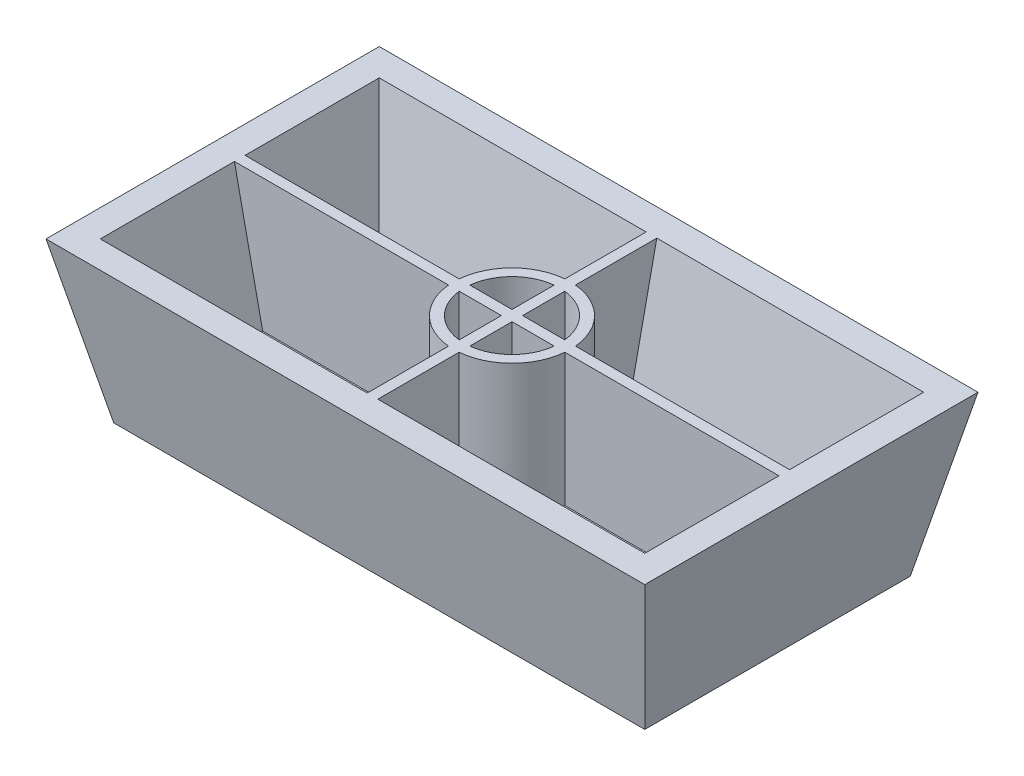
ISO-10303-21;
HEADER;
FILE_DESCRIPTION(('STEP AP214'),'2;1');
FILE_NAME('part.step','',(''),(''),'','','');
FILE_SCHEMA(('AUTOMOTIVE_DESIGN { 1 0 10303 214 1 1 1 1 }'));
ENDSEC;
DATA;
#1=APPLICATION_CONTEXT('core data for automotive mechanical design processes');
#2=APPLICATION_PROTOCOL_DEFINITION('international standard','automotive_design',2000,#1);
#3=PRODUCT_CONTEXT('',#1,'mechanical');
#4=PRODUCT('Part','Part','',(#3));
#5=PRODUCT_RELATED_PRODUCT_CATEGORY('part','',(#4));
#6=PRODUCT_DEFINITION_FORMATION('','',#4);
#7=PRODUCT_DEFINITION_CONTEXT('part definition',#1,'design');
#8=PRODUCT_DEFINITION('design','',#6,#7);
#9=PRODUCT_DEFINITION_SHAPE('','',#8);
#10=(LENGTH_UNIT() NAMED_UNIT(*) SI_UNIT(.MILLI.,.METRE.));
#11=(NAMED_UNIT(*) PLANE_ANGLE_UNIT() SI_UNIT($,.RADIAN.));
#12=(NAMED_UNIT(*) SI_UNIT($,.STERADIAN.) SOLID_ANGLE_UNIT());
#13=UNCERTAINTY_MEASURE_WITH_UNIT(LENGTH_MEASURE(1.E-05),#10,'distance_accuracy_value','');
#14=(GEOMETRIC_REPRESENTATION_CONTEXT(3) GLOBAL_UNCERTAINTY_ASSIGNED_CONTEXT((#13)) GLOBAL_UNIT_ASSIGNED_CONTEXT((#10,
#11,#12)) REPRESENTATION_CONTEXT('',''));
#15=CARTESIAN_POINT('',(0.,0.,0.));
#16=DIRECTION('',(0.,0.,1.));
#17=DIRECTION('',(1.,0.,0.));
#18=AXIS2_PLACEMENT_3D('',#15,#16,#17);
#19=CARTESIAN_POINT('',(0.,5.,-50.));
#20=DIRECTION('',(0.,-1.,0.));
#21=DIRECTION('',(0.,0.,-1.));
#22=AXIS2_PLACEMENT_3D('',#19,#20,#21);
#23=PLANE('',#22);
#24=DIRECTION('',(0.,0.,1.));
#25=VECTOR('',#24,1.);
#26=CARTESIAN_POINT('',(49.,5.,-50.));
#27=LINE('',#26,#25);
#28=CARTESIAN_POINT('',(49.,5.,-14.0455488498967));
#29=VERTEX_POINT('',#28);
#30=CARTESIAN_POINT('',(49.,5.,-4.04892016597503));
#31=VERTEX_POINT('',#30);
#32=EDGE_CURVE('E272',#29,#31,#27,.T.);
#33=ORIENTED_EDGE('',*,*,#32,.F.);
#34=CARTESIAN_POINT('',(50.,5.,-25.));
#35=DIRECTION('',(0.,-1.,0.));
#36=DIRECTION('',(0.,0.,-1.));
#37=AXIS2_PLACEMENT_3D('',#34,#35,#36);
#38=CIRCLE('',#37,11.);
#39=CARTESIAN_POINT('',(39.0455488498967,5.,-24.));
#40=VERTEX_POINT('',#39);
#41=EDGE_CURVE('E341',#40,#29,#38,.F.);
#42=ORIENTED_EDGE('',*,*,#41,.F.);
#43=DIRECTION('',(1.,0.,0.));
#44=VECTOR('',#43,1.);
#45=CARTESIAN_POINT('',(0.,5.,-24.));
#46=LINE('',#45,#44);
#47=CARTESIAN_POINT('',(4.04892016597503,5.,-24.));
#48=VERTEX_POINT('',#47);
#49=EDGE_CURVE('E566',#48,#40,#46,.T.);
#50=ORIENTED_EDGE('',*,*,#49,.F.);
#51=DIRECTION('',(0.,0.,-1.));
#52=VECTOR('',#51,1.);
#53=CARTESIAN_POINT('',(4.04892016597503,5.,-50.));
#54=LINE('',#53,#52);
#55=CARTESIAN_POINT('',(4.04892016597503,5.,-4.04892016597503));
#56=VERTEX_POINT('',#55);
#57=EDGE_CURVE('E418',#48,#56,#54,.F.);
#58=ORIENTED_EDGE('',*,*,#57,.T.);
#59=DIRECTION('',(-1.,0.,0.));
#60=VECTOR('',#59,1.);
#61=CARTESIAN_POINT('',(0.,5.,-4.04892016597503));
#62=LINE('',#61,#60);
#63=EDGE_CURVE('E424',#56,#31,#62,.F.);
#64=ORIENTED_EDGE('',*,*,#63,.T.);
#65=EDGE_LOOP('',(#33,#42,#50,#58,#64));
#66=FACE_BOUND('',#65,.T.);
#67=ADVANCED_FACE('F33',(#66),#23,.F.);
#68=CARTESIAN_POINT('',(50.,30.,-25.));
#69=DIRECTION('',(0.,-1.,0.));
#70=DIRECTION('',(0.,0.,-1.));
#71=AXIS2_PLACEMENT_3D('',#68,#69,#70);
#72=CYLINDRICAL_SURFACE('',#71,9.);
#73=CARTESIAN_POINT('',(50.,30.,-25.));
#74=DIRECTION('',(0.,-1.,0.));
#75=DIRECTION('',(0.,0.,-1.));
#76=AXIS2_PLACEMENT_3D('',#73,#74,#75);
#77=CIRCLE('',#76,9.);
#78=CARTESIAN_POINT('',(41.0557280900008,30.,-24.));
#79=VERTEX_POINT('',#78);
#80=CARTESIAN_POINT('',(49.,30.,-16.0557280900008));
#81=VERTEX_POINT('',#80);
#82=EDGE_CURVE('E409',#79,#81,#77,.F.);
#83=ORIENTED_EDGE('',*,*,#82,.T.);
#84=DIRECTION('',(0.,-1.,0.));
#85=VECTOR('',#84,1.);
#86=CARTESIAN_POINT('',(49.,30.,-16.0557280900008));
#87=LINE('',#86,#85);
#88=CARTESIAN_POINT('',(49.,5.,-16.0557280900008));
#89=VERTEX_POINT('',#88);
#90=EDGE_CURVE('E522',#81,#89,#87,.T.);
#91=ORIENTED_EDGE('',*,*,#90,.T.);
#92=CARTESIAN_POINT('',(50.,5.,-25.));
#93=DIRECTION('',(0.,-1.,0.));
#94=DIRECTION('',(0.,0.,-1.));
#95=AXIS2_PLACEMENT_3D('',#92,#93,#94);
#96=CIRCLE('',#95,9.);
#97=CARTESIAN_POINT('',(41.0557280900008,5.,-24.));
#98=VERTEX_POINT('',#97);
#99=EDGE_CURVE('E415',#98,#89,#96,.F.);
#100=ORIENTED_EDGE('',*,*,#99,.F.);
#101=DIRECTION('',(0.,-1.,0.));
#102=VECTOR('',#101,1.);
#103=CARTESIAN_POINT('',(41.0557280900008,30.,-24.));
#104=LINE('',#103,#102);
#105=EDGE_CURVE('E449',#98,#79,#104,.F.);
#106=ORIENTED_EDGE('',*,*,#105,.T.);
#107=EDGE_LOOP('',(#83,#91,#100,#106));
#108=FACE_BOUND('',#107,.T.);
#109=ADVANCED_FACE('F545',(#108),#72,.F.);
#110=CARTESIAN_POINT('',(50.,30.,-25.));
#111=DIRECTION('',(0.,-1.,0.));
#112=DIRECTION('',(0.,0.,-1.));
#113=AXIS2_PLACEMENT_3D('',#110,#111,#112);
#114=CYLINDRICAL_SURFACE('',#113,11.);
#115=DIRECTION('',(0.,-1.,0.));
#116=VECTOR('',#115,1.);
#117=CARTESIAN_POINT('',(49.,30.,-14.0455488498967));
#118=LINE('',#117,#116);
#119=CARTESIAN_POINT('',(49.,30.,-14.0455488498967));
#120=VERTEX_POINT('',#119);
#121=EDGE_CURVE('E508',#120,#29,#118,.T.);
#122=ORIENTED_EDGE('',*,*,#121,.F.);
#123=CARTESIAN_POINT('',(50.,30.,-25.));
#124=DIRECTION('',(0.,-1.,0.));
#125=DIRECTION('',(0.,0.,-1.));
#126=AXIS2_PLACEMENT_3D('',#123,#124,#125);
#127=CIRCLE('',#126,11.);
#128=CARTESIAN_POINT('',(39.0455488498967,30.,-24.));
#129=VERTEX_POINT('',#128);
#130=EDGE_CURVE('E286',#129,#120,#127,.F.);
#131=ORIENTED_EDGE('',*,*,#130,.F.);
#132=DIRECTION('',(0.,-1.,0.));
#133=VECTOR('',#132,1.);
#134=CARTESIAN_POINT('',(39.0455488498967,30.,-24.));
#135=LINE('',#134,#133);
#136=EDGE_CURVE('E869',#40,#129,#135,.F.);
#137=ORIENTED_EDGE('',*,*,#136,.F.);
#138=ORIENTED_EDGE('',*,*,#41,.T.);
#139=EDGE_LOOP('',(#122,#131,#137,#138));
#140=FACE_BOUND('',#139,.T.);
#141=ADVANCED_FACE('F594',(#140),#114,.T.);
#142=DIRECTION('',(0.,0.,1.));
#143=VECTOR('',#142,1.);
#144=CARTESIAN_POINT('',(49.,5.,-50.));
#145=LINE('',#144,#143);
#146=CARTESIAN_POINT('',(49.,5.,-24.));
#147=VERTEX_POINT('',#146);
#148=EDGE_CURVE('E525',#147,#89,#145,.T.);
#149=ORIENTED_EDGE('',*,*,#148,.F.);
#150=DIRECTION('',(1.,0.,0.));
#151=VECTOR('',#150,1.);
#152=CARTESIAN_POINT('',(0.,5.,-24.));
#153=LINE('',#152,#151);
#154=EDGE_CURVE('E346',#98,#147,#153,.T.);
#155=ORIENTED_EDGE('',*,*,#154,.F.);
#156=ORIENTED_EDGE('',*,*,#99,.T.);
#157=EDGE_LOOP('',(#149,#155,#156));
#158=FACE_BOUND('',#157,.T.);
#159=ADVANCED_FACE('F590',(#158),#23,.F.);
#160=DIRECTION('',(0.,0.,1.));
#161=VECTOR('',#160,1.);
#162=CARTESIAN_POINT('',(49.,5.,-50.));
#163=LINE('',#162,#161);
#164=CARTESIAN_POINT('',(49.,5.,-45.951079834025));
#165=VERTEX_POINT('',#164);
#166=CARTESIAN_POINT('',(49.,5.,-35.9544511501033));
#167=VERTEX_POINT('',#166);
#168=EDGE_CURVE('E440',#165,#167,#163,.T.);
#169=ORIENTED_EDGE('',*,*,#168,.F.);
#170=DIRECTION('',(1.,0.,0.));
#171=VECTOR('',#170,1.);
#172=CARTESIAN_POINT('',(0.,5.,-45.951079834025));
#173=LINE('',#172,#171);
#174=CARTESIAN_POINT('',(4.04892016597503,5.,-45.951079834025));
#175=VERTEX_POINT('',#174);
#176=EDGE_CURVE('E432',#165,#175,#173,.F.);
#177=ORIENTED_EDGE('',*,*,#176,.T.);
#178=CARTESIAN_POINT('',(4.04892016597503,5.,-26.));
#179=VERTEX_POINT('',#178);
#180=EDGE_CURVE('E377',#175,#179,#54,.F.);
#181=ORIENTED_EDGE('',*,*,#180,.T.);
#182=DIRECTION('',(1.,0.,0.));
#183=VECTOR('',#182,1.);
#184=CARTESIAN_POINT('',(0.,5.,-26.));
#185=LINE('',#184,#183);
#186=CARTESIAN_POINT('',(39.0455488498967,5.,-26.));
#187=VERTEX_POINT('',#186);
#188=EDGE_CURVE('E374',#179,#187,#185,.T.);
#189=ORIENTED_EDGE('',*,*,#188,.T.);
#190=EDGE_CURVE('E320',#167,#187,#38,.F.);
#191=ORIENTED_EDGE('',*,*,#190,.F.);
#192=EDGE_LOOP('',(#169,#177,#181,#189,#191));
#193=FACE_BOUND('',#192,.T.);
#194=ADVANCED_FACE('F375',(#193),#23,.F.);
#195=CARTESIAN_POINT('',(0.,1.0395584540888,-4.89073800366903));
#196=DIRECTION('',(0.,-0.20791169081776,0.978147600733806));
#197=DIRECTION('',(0.,-0.978147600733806,-0.20791169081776));
#198=AXIS2_PLACEMENT_3D('',#195,#196,#197);
#199=PLANE('',#198);
#200=DIRECTION('',(-1.,0.,0.));
#201=VECTOR('',#200,1.);
#202=CARTESIAN_POINT('',(0.,30.,1.26499387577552));
#203=LINE('',#202,#201);
#204=CARTESIAN_POINT('',(-1.26499387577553,30.,1.26499387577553));
#205=VERTEX_POINT('',#204);
#206=CARTESIAN_POINT('',(49.,30.,1.26499387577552));
#207=VERTEX_POINT('',#206);
#208=EDGE_CURVE('E284',#205,#207,#203,.F.);
#209=ORIENTED_EDGE('',*,*,#208,.T.);
#210=DIRECTION('',(0.,0.978147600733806,0.20791169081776));
#211=VECTOR('',#210,1.);
#212=CARTESIAN_POINT('',(49.,1.0395584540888,-4.89073800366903));
#213=LINE('',#212,#211);
#214=EDGE_CURVE('E266',#207,#31,#213,.F.);
#215=ORIENTED_EDGE('',*,*,#214,.T.);
#216=ORIENTED_EDGE('',*,*,#63,.F.);
#217=DIRECTION('',(0.203558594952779,-0.957667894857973,-0.203558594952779));
#218=VECTOR('',#217,1.);
#219=CARTESIAN_POINT('',(4.68808488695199,1.99296640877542,-4.68808488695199));
#220=LINE('',#219,#218);
#221=EDGE_CURVE('E293',#205,#56,#220,.T.);
#222=ORIENTED_EDGE('',*,*,#221,.F.);
#223=EDGE_LOOP('',(#209,#215,#216,#222));
#224=FACE_BOUND('',#223,.T.);
#225=ADVANCED_FACE('F291',(#224),#199,.F.);
#226=CARTESIAN_POINT('',(0.,1.0395584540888,-45.109261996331));
#227=DIRECTION('',(0.,-0.20791169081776,-0.978147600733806));
#228=DIRECTION('',(0.,0.978147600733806,-0.20791169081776));
#229=AXIS2_PLACEMENT_3D('',#226,#227,#228);
#230=PLANE('',#229);
#231=ORIENTED_EDGE('',*,*,#176,.F.);
#232=DIRECTION('',(0.,-0.978147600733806,0.20791169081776));
#233=VECTOR('',#232,1.);
#234=CARTESIAN_POINT('',(49.,1.0395584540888,-45.109261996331));
#235=LINE('',#234,#233);
#236=CARTESIAN_POINT('',(49.,30.,-51.2649938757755));
#237=VERTEX_POINT('',#236);
#238=EDGE_CURVE('E56',#165,#237,#235,.F.);
#239=ORIENTED_EDGE('',*,*,#238,.T.);
#240=DIRECTION('',(1.,0.,0.));
#241=VECTOR('',#240,1.);
#242=CARTESIAN_POINT('',(0.,30.,-51.2649938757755));
#243=LINE('',#242,#241);
#244=CARTESIAN_POINT('',(-1.26499387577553,30.,-51.2649938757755));
#245=VERTEX_POINT('',#244);
#246=EDGE_CURVE('E304',#237,#245,#243,.F.);
#247=ORIENTED_EDGE('',*,*,#246,.T.);
#248=DIRECTION('',(0.203558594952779,-0.957667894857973,0.203558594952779));
#249=VECTOR('',#248,1.);
#250=CARTESIAN_POINT('',(6.75988996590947,-7.75411014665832,-43.2401100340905));
#251=LINE('',#250,#249);
#252=EDGE_CURVE('E307',#245,#175,#251,.T.);
#253=ORIENTED_EDGE('',*,*,#252,.T.);
#254=EDGE_LOOP('',(#231,#239,#247,#253));
#255=FACE_BOUND('',#254,.T.);
#256=ADVANCED_FACE('F442',(#255),#230,.F.);
#257=CARTESIAN_POINT('',(49.,5.,-33.9442719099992));
#258=VERTEX_POINT('',#257);
#259=CARTESIAN_POINT('',(41.0557280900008,5.,-26.));
#260=VERTEX_POINT('',#259);
#261=EDGE_CURVE('E414',#258,#260,#96,.F.);
#262=ORIENTED_EDGE('',*,*,#261,.F.);
#263=DIRECTION('',(0.,-1.,0.));
#264=VECTOR('',#263,1.);
#265=CARTESIAN_POINT('',(49.,30.,-33.9442719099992));
#266=LINE('',#265,#264);
#267=CARTESIAN_POINT('',(49.,30.,-33.9442719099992));
#268=VERTEX_POINT('',#267);
#269=EDGE_CURVE('E514',#258,#268,#266,.F.);
#270=ORIENTED_EDGE('',*,*,#269,.T.);
#271=CARTESIAN_POINT('',(41.0557280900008,30.,-26.));
#272=VERTEX_POINT('',#271);
#273=EDGE_CURVE('E408',#268,#272,#77,.F.);
#274=ORIENTED_EDGE('',*,*,#273,.T.);
#275=DIRECTION('',(0.,-1.,0.));
#276=VECTOR('',#275,1.);
#277=CARTESIAN_POINT('',(41.0557280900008,30.,-26.));
#278=LINE('',#277,#276);
#279=EDGE_CURVE('E389',#260,#272,#278,.F.);
#280=ORIENTED_EDGE('',*,*,#279,.F.);
#281=EDGE_LOOP('',(#262,#270,#274,#280));
#282=FACE_BOUND('',#281,.T.);
#283=ADVANCED_FACE('F596',(#282),#72,.F.);
#284=DIRECTION('',(0.,-1.,0.));
#285=VECTOR('',#284,1.);
#286=CARTESIAN_POINT('',(49.,30.,-35.9544511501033));
#287=LINE('',#286,#285);
#288=CARTESIAN_POINT('',(49.,30.,-35.9544511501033));
#289=VERTEX_POINT('',#288);
#290=EDGE_CURVE('E369',#167,#289,#287,.F.);
#291=ORIENTED_EDGE('',*,*,#290,.F.);
#292=ORIENTED_EDGE('',*,*,#190,.T.);
#293=DIRECTION('',(0.,-1.,0.));
#294=VECTOR('',#293,1.);
#295=CARTESIAN_POINT('',(39.0455488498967,30.,-26.));
#296=LINE('',#295,#294);
#297=CARTESIAN_POINT('',(39.0455488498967,30.,-26.));
#298=VERTEX_POINT('',#297);
#299=EDGE_CURVE('E366',#187,#298,#296,.F.);
#300=ORIENTED_EDGE('',*,*,#299,.T.);
#301=EDGE_CURVE('E399',#289,#298,#127,.F.);
#302=ORIENTED_EDGE('',*,*,#301,.F.);
#303=EDGE_LOOP('',(#291,#292,#300,#302));
#304=FACE_BOUND('',#303,.T.);
#305=ADVANCED_FACE('F364',(#304),#114,.T.);
#306=DIRECTION('',(0.,0.,1.));
#307=VECTOR('',#306,1.);
#308=CARTESIAN_POINT('',(49.,5.,-50.));
#309=LINE('',#308,#307);
#310=CARTESIAN_POINT('',(49.,5.,-26.));
#311=VERTEX_POINT('',#310);
#312=EDGE_CURVE('E517',#258,#311,#309,.T.);
#313=ORIENTED_EDGE('',*,*,#312,.F.);
#314=ORIENTED_EDGE('',*,*,#261,.T.);
#315=DIRECTION('',(1.,0.,0.));
#316=VECTOR('',#315,1.);
#317=CARTESIAN_POINT('',(0.,5.,-26.));
#318=LINE('',#317,#316);
#319=EDGE_CURVE('E342',#260,#311,#318,.T.);
#320=ORIENTED_EDGE('',*,*,#319,.T.);
#321=EDGE_LOOP('',(#313,#314,#320));
#322=FACE_BOUND('',#321,.T.);
#323=ADVANCED_FACE('F735',(#322),#23,.F.);
#324=CARTESIAN_POINT('',(-1.26499387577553,30.,-26.));
#325=DIRECTION('',(0.,0.,-1.));
#326=DIRECTION('',(-1.,0.,0.));
#327=AXIS2_PLACEMENT_3D('',#324,#325,#326);
#328=PLANE('',#327);
#329=DIRECTION('',(-1.,0.,0.));
#330=VECTOR('',#329,1.);
#331=CARTESIAN_POINT('',(-1.26499387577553,30.,-26.));
#332=LINE('',#331,#330);
#333=CARTESIAN_POINT('',(49.,30.,-26.));
#334=VERTEX_POINT('',#333);
#335=EDGE_CURVE('E450',#272,#334,#332,.F.);
#336=ORIENTED_EDGE('',*,*,#335,.T.);
#337=DIRECTION('',(0.,-1.,0.));
#338=VECTOR('',#337,1.);
#339=CARTESIAN_POINT('',(49.,30.,-26.));
#340=LINE('',#339,#338);
#341=EDGE_CURVE('E519',#334,#311,#340,.T.);
#342=ORIENTED_EDGE('',*,*,#341,.T.);
#343=ORIENTED_EDGE('',*,*,#319,.F.);
#344=ORIENTED_EDGE('',*,*,#279,.T.);
#345=EDGE_LOOP('',(#336,#342,#343,#344));
#346=FACE_BOUND('',#345,.T.);
#347=ADVANCED_FACE('F571',(#346),#328,.T.);
#348=CARTESIAN_POINT('',(-1.26499387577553,30.,-24.));
#349=DIRECTION('',(0.,0.,-1.));
#350=DIRECTION('',(-1.,0.,0.));
#351=AXIS2_PLACEMENT_3D('',#348,#349,#350);
#352=PLANE('',#351);
#353=DIRECTION('',(0.,-1.,0.));
#354=VECTOR('',#353,1.);
#355=CARTESIAN_POINT('',(49.,30.,-24.));
#356=LINE('',#355,#354);
#357=CARTESIAN_POINT('',(49.,30.,-24.));
#358=VERTEX_POINT('',#357);
#359=EDGE_CURVE('E37',#358,#147,#356,.T.);
#360=ORIENTED_EDGE('',*,*,#359,.F.);
#361=DIRECTION('',(-1.,0.,0.));
#362=VECTOR('',#361,1.);
#363=CARTESIAN_POINT('',(-1.26499387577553,30.,-24.));
#364=LINE('',#363,#362);
#365=EDGE_CURVE('E466',#79,#358,#364,.F.);
#366=ORIENTED_EDGE('',*,*,#365,.F.);
#367=ORIENTED_EDGE('',*,*,#105,.F.);
#368=ORIENTED_EDGE('',*,*,#154,.T.);
#369=EDGE_LOOP('',(#360,#366,#367,#368));
#370=FACE_BOUND('',#369,.T.);
#371=ADVANCED_FACE('F733',(#370),#352,.F.);
#372=CARTESIAN_POINT('',(51.,5.,-14.0455488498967));
#373=VERTEX_POINT('',#372);
#374=CARTESIAN_POINT('',(60.9544511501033,5.,-24.));
#375=VERTEX_POINT('',#374);
#376=EDGE_CURVE('E340',#373,#375,#38,.F.);
#377=ORIENTED_EDGE('',*,*,#376,.F.);
#378=DIRECTION('',(0.,0.,1.));
#379=VECTOR('',#378,1.);
#380=CARTESIAN_POINT('',(51.,5.,-50.));
#381=LINE('',#380,#379);
#382=CARTESIAN_POINT('',(51.,5.,-4.04892016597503));
#383=VERTEX_POINT('',#382);
#384=EDGE_CURVE('E482',#373,#383,#381,.T.);
#385=ORIENTED_EDGE('',*,*,#384,.T.);
#386=CARTESIAN_POINT('',(95.951079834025,5.,-4.04892016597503));
#387=VERTEX_POINT('',#386);
#388=EDGE_CURVE('E417',#383,#387,#62,.F.);
#389=ORIENTED_EDGE('',*,*,#388,.T.);
#390=DIRECTION('',(0.,0.,1.));
#391=VECTOR('',#390,1.);
#392=CARTESIAN_POINT('',(95.951079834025,5.,-50.));
#393=LINE('',#392,#391);
#394=CARTESIAN_POINT('',(95.951079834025,5.,-24.));
#395=VERTEX_POINT('',#394);
#396=EDGE_CURVE('E429',#387,#395,#393,.F.);
#397=ORIENTED_EDGE('',*,*,#396,.T.);
#398=EDGE_CURVE('E562',#375,#395,#46,.T.);
#399=ORIENTED_EDGE('',*,*,#398,.F.);
#400=EDGE_LOOP('',(#377,#385,#389,#397,#399));
#401=FACE_BOUND('',#400,.T.);
#402=ADVANCED_FACE('F690',(#401),#23,.F.);
#403=CARTESIAN_POINT('',(4.89073800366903,1.0395584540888,0.));
#404=DIRECTION('',(-0.978147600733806,-0.20791169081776,0.));
#405=DIRECTION('',(0.20791169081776,-0.978147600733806,0.));
#406=AXIS2_PLACEMENT_3D('',#403,#404,#405);
#407=PLANE('',#406);
#408=ORIENTED_EDGE('',*,*,#57,.F.);
#409=DIRECTION('',(0.20791169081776,-0.978147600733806,0.));
#410=VECTOR('',#409,1.);
#411=CARTESIAN_POINT('',(4.89073800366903,1.0395584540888,-24.));
#412=LINE('',#411,#410);
#413=CARTESIAN_POINT('',(-1.26499387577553,30.,-24.));
#414=VERTEX_POINT('',#413);
#415=EDGE_CURVE('E563',#48,#414,#412,.F.);
#416=ORIENTED_EDGE('',*,*,#415,.T.);
#417=DIRECTION('',(0.,0.,-1.));
#418=VECTOR('',#417,1.);
#419=CARTESIAN_POINT('',(-1.26499387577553,30.,-50.));
#420=LINE('',#419,#418);
#421=EDGE_CURVE('E436',#414,#205,#420,.F.);
#422=ORIENTED_EDGE('',*,*,#421,.T.);
#423=ORIENTED_EDGE('',*,*,#221,.T.);
#424=EDGE_LOOP('',(#408,#416,#422,#423));
#425=FACE_BOUND('',#424,.T.);
#426=ADVANCED_FACE('F653',(#425),#407,.F.);
#427=CARTESIAN_POINT('',(95.109261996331,1.0395584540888,0.));
#428=DIRECTION('',(0.978147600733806,-0.20791169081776,0.));
#429=DIRECTION('',(0.20791169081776,0.978147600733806,0.));
#430=AXIS2_PLACEMENT_3D('',#427,#428,#429);
#431=PLANE('',#430);
#432=DIRECTION('',(0.,0.,1.));
#433=VECTOR('',#432,1.);
#434=CARTESIAN_POINT('',(101.264993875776,30.,-50.));
#435=LINE('',#434,#433);
#436=CARTESIAN_POINT('',(101.264993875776,30.,1.26499387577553));
#437=VERTEX_POINT('',#436);
#438=CARTESIAN_POINT('',(101.264993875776,30.,-24.));
#439=VERTEX_POINT('',#438);
#440=EDGE_CURVE('E297',#437,#439,#435,.F.);
#441=ORIENTED_EDGE('',*,*,#440,.T.);
#442=DIRECTION('',(0.20791169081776,0.978147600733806,0.));
#443=VECTOR('',#442,1.);
#444=CARTESIAN_POINT('',(95.109261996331,1.0395584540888,-24.));
#445=LINE('',#444,#443);
#446=EDGE_CURVE('E560',#439,#395,#445,.F.);
#447=ORIENTED_EDGE('',*,*,#446,.T.);
#448=ORIENTED_EDGE('',*,*,#396,.F.);
#449=DIRECTION('',(-0.203558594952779,-0.957667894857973,-0.203558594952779));
#450=VECTOR('',#449,1.);
#451=CARTESIAN_POINT('',(95.311915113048,1.99296640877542,-4.68808488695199));
#452=LINE('',#451,#450);
#453=EDGE_CURVE('E420',#437,#387,#452,.T.);
#454=ORIENTED_EDGE('',*,*,#453,.F.);
#455=EDGE_LOOP('',(#441,#447,#448,#454));
#456=FACE_BOUND('',#455,.T.);
#457=ADVANCED_FACE('F707',(#456),#431,.F.);
#458=DIRECTION('',(0.,-1.,0.));
#459=VECTOR('',#458,1.);
#460=CARTESIAN_POINT('',(51.,30.,-16.0557280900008));
#461=LINE('',#460,#459);
#462=CARTESIAN_POINT('',(51.,30.,-16.0557280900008));
#463=VERTEX_POINT('',#462);
#464=CARTESIAN_POINT('',(51.,5.,-16.0557280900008));
#465=VERTEX_POINT('',#464);
#466=EDGE_CURVE('E503',#463,#465,#461,.T.);
#467=ORIENTED_EDGE('',*,*,#466,.F.);
#468=CARTESIAN_POINT('',(58.9442719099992,30.,-24.));
#469=VERTEX_POINT('',#468);
#470=EDGE_CURVE('E407',#463,#469,#77,.F.);
#471=ORIENTED_EDGE('',*,*,#470,.T.);
#472=DIRECTION('',(0.,-1.,0.));
#473=VECTOR('',#472,1.);
#474=CARTESIAN_POINT('',(58.9442719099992,30.,-24.));
#475=LINE('',#474,#473);
#476=CARTESIAN_POINT('',(58.9442719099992,5.,-24.));
#477=VERTEX_POINT('',#476);
#478=EDGE_CURVE('E453',#469,#477,#475,.T.);
#479=ORIENTED_EDGE('',*,*,#478,.T.);
#480=EDGE_CURVE('E413',#465,#477,#96,.F.);
#481=ORIENTED_EDGE('',*,*,#480,.F.);
#482=EDGE_LOOP('',(#467,#471,#479,#481));
#483=FACE_BOUND('',#482,.T.);
#484=ADVANCED_FACE('F625',(#483),#72,.F.);
#485=CARTESIAN_POINT('',(51.,30.,-14.0455488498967));
#486=VERTEX_POINT('',#485);
#487=CARTESIAN_POINT('',(60.9544511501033,30.,-24.));
#488=VERTEX_POINT('',#487);
#489=EDGE_CURVE('E403',#486,#488,#127,.F.);
#490=ORIENTED_EDGE('',*,*,#489,.F.);
#491=DIRECTION('',(0.,-1.,0.));
#492=VECTOR('',#491,1.);
#493=CARTESIAN_POINT('',(51.,30.,-14.0455488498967));
#494=LINE('',#493,#492);
#495=EDGE_CURVE('E478',#486,#373,#494,.T.);
#496=ORIENTED_EDGE('',*,*,#495,.T.);
#497=ORIENTED_EDGE('',*,*,#376,.T.);
#498=DIRECTION('',(0.,-1.,0.));
#499=VECTOR('',#498,1.);
#500=CARTESIAN_POINT('',(60.9544511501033,30.,-24.));
#501=LINE('',#500,#499);
#502=EDGE_CURVE('E557',#488,#375,#501,.T.);
#503=ORIENTED_EDGE('',*,*,#502,.F.);
#504=EDGE_LOOP('',(#490,#496,#497,#503));
#505=FACE_BOUND('',#504,.T.);
#506=ADVANCED_FACE('F561',(#505),#114,.T.);
#507=CARTESIAN_POINT('',(51.,5.,-24.));
#508=VERTEX_POINT('',#507);
#509=EDGE_CURVE('E348',#508,#477,#153,.T.);
#510=ORIENTED_EDGE('',*,*,#509,.F.);
#511=DIRECTION('',(0.,0.,1.));
#512=VECTOR('',#511,1.);
#513=CARTESIAN_POINT('',(51.,5.,-50.));
#514=LINE('',#513,#512);
#515=EDGE_CURVE('E505',#508,#465,#514,.T.);
#516=ORIENTED_EDGE('',*,*,#515,.T.);
#517=ORIENTED_EDGE('',*,*,#480,.T.);
#518=EDGE_LOOP('',(#510,#516,#517));
#519=FACE_BOUND('',#518,.T.);
#520=ADVANCED_FACE('F584',(#519),#23,.F.);
#521=CARTESIAN_POINT('',(95.951079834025,5.,-45.951079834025));
#522=VERTEX_POINT('',#521);
#523=CARTESIAN_POINT('',(51.,5.,-45.951079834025));
#524=VERTEX_POINT('',#523);
#525=EDGE_CURVE('E434',#522,#524,#173,.F.);
#526=ORIENTED_EDGE('',*,*,#525,.T.);
#527=DIRECTION('',(0.,0.,1.));
#528=VECTOR('',#527,1.);
#529=CARTESIAN_POINT('',(51.,5.,-50.));
#530=LINE('',#529,#528);
#531=CARTESIAN_POINT('',(51.,5.,-35.9544511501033));
#532=VERTEX_POINT('',#531);
#533=EDGE_CURVE('E492',#524,#532,#530,.T.);
#534=ORIENTED_EDGE('',*,*,#533,.T.);
#535=CARTESIAN_POINT('',(60.9544511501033,5.,-26.));
#536=VERTEX_POINT('',#535);
#537=EDGE_CURVE('E337',#536,#532,#38,.F.);
#538=ORIENTED_EDGE('',*,*,#537,.F.);
#539=CARTESIAN_POINT('',(95.951079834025,5.,-26.));
#540=VERTEX_POINT('',#539);
#541=EDGE_CURVE('E382',#536,#540,#185,.T.);
#542=ORIENTED_EDGE('',*,*,#541,.T.);
#543=EDGE_CURVE('E426',#540,#522,#393,.F.);
#544=ORIENTED_EDGE('',*,*,#543,.T.);
#545=EDGE_LOOP('',(#526,#534,#538,#542,#544));
#546=FACE_BOUND('',#545,.T.);
#547=ADVANCED_FACE('F575',(#546),#23,.F.);
#548=CARTESIAN_POINT('',(0.,30.,-50.));
#549=DIRECTION('',(0.,-1.,0.));
#550=DIRECTION('',(0.,0.,-1.));
#551=AXIS2_PLACEMENT_3D('',#548,#549,#550);
#552=PLANE('',#551);
#553=CARTESIAN_POINT('',(51.,30.,-26.));
#554=VERTEX_POINT('',#553);
#555=CARTESIAN_POINT('',(58.9442719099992,30.,-26.));
#556=VERTEX_POINT('',#555);
#557=EDGE_CURVE('E452',#554,#556,#332,.F.);
#558=ORIENTED_EDGE('',*,*,#557,.F.);
#559=DIRECTION('',(0.,0.,-1.));
#560=VECTOR('',#559,1.);
#561=CARTESIAN_POINT('',(51.,30.,-51.2649938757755));
#562=LINE('',#561,#560);
#563=CARTESIAN_POINT('',(51.,30.,-33.9442719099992));
#564=VERTEX_POINT('',#563);
#565=EDGE_CURVE('E529',#564,#554,#562,.F.);
#566=ORIENTED_EDGE('',*,*,#565,.F.);
#567=EDGE_CURVE('E404',#556,#564,#77,.F.);
#568=ORIENTED_EDGE('',*,*,#567,.F.);
#569=EDGE_LOOP('',(#558,#566,#568));
#570=FACE_BOUND('',#569,.T.);
#571=DIRECTION('',(0.,0.,-1.));
#572=VECTOR('',#571,1.);
#573=CARTESIAN_POINT('',(49.,30.,-51.2649938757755));
#574=LINE('',#573,#572);
#575=EDGE_CURVE('E289',#237,#289,#574,.F.);
#576=ORIENTED_EDGE('',*,*,#575,.T.);
#577=ORIENTED_EDGE('',*,*,#301,.T.);
#578=CARTESIAN_POINT('',(-1.26499387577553,30.,-26.));
#579=VERTEX_POINT('',#578);
#580=EDGE_CURVE('E385',#579,#298,#332,.F.);
#581=ORIENTED_EDGE('',*,*,#580,.F.);
#582=EDGE_CURVE('E299',#245,#579,#420,.F.);
#583=ORIENTED_EDGE('',*,*,#582,.F.);
#584=ORIENTED_EDGE('',*,*,#246,.F.);
#585=EDGE_LOOP('',(#576,#577,#581,#583,#584));
#586=FACE_BOUND('',#585,.T.);
#587=CARTESIAN_POINT('',(51.,30.,1.26499387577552));
#588=VERTEX_POINT('',#587);
#589=EDGE_CURVE('E295',#588,#437,#203,.F.);
#590=ORIENTED_EDGE('',*,*,#589,.F.);
#591=EDGE_CURVE('E530',#486,#588,#562,.F.);
#592=ORIENTED_EDGE('',*,*,#591,.F.);
#593=ORIENTED_EDGE('',*,*,#489,.T.);
#594=EDGE_CURVE('E470',#488,#439,#364,.F.);
#595=ORIENTED_EDGE('',*,*,#594,.T.);
#596=ORIENTED_EDGE('',*,*,#440,.F.);
#597=EDGE_LOOP('',(#590,#592,#593,#595,#596));
#598=FACE_BOUND('',#597,.T.);
#599=ORIENTED_EDGE('',*,*,#470,.F.);
#600=CARTESIAN_POINT('',(51.,30.,-24.));
#601=VERTEX_POINT('',#600);
#602=EDGE_CURVE('E533',#601,#463,#562,.F.);
#603=ORIENTED_EDGE('',*,*,#602,.F.);
#604=EDGE_CURVE('E467',#601,#469,#364,.F.);
#605=ORIENTED_EDGE('',*,*,#604,.T.);
#606=EDGE_LOOP('',(#599,#603,#605));
#607=FACE_BOUND('',#606,.T.);
#608=DIRECTION('',(1.,0.,0.));
#609=VECTOR('',#608,1.);
#610=CARTESIAN_POINT('',(0.,30.,-56.3766968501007));
#611=LINE('',#610,#609);
#612=CARTESIAN_POINT('',(106.376696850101,30.,-56.3766968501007));
#613=VERTEX_POINT('',#612);
#614=CARTESIAN_POINT('',(-6.37669685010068,30.,-56.3766968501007));
#615=VERTEX_POINT('',#614);
#616=EDGE_CURVE('E326',#613,#615,#611,.F.);
#617=ORIENTED_EDGE('',*,*,#616,.T.);
#618=DIRECTION('',(0.,0.,-1.));
#619=VECTOR('',#618,1.);
#620=CARTESIAN_POINT('',(-6.37669685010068,30.,-50.));
#621=LINE('',#620,#619);
#622=CARTESIAN_POINT('',(-6.37669685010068,30.,6.37669685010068));
#623=VERTEX_POINT('',#622);
#624=EDGE_CURVE('E316',#615,#623,#621,.F.);
#625=ORIENTED_EDGE('',*,*,#624,.T.);
#626=DIRECTION('',(-1.,0.,0.));
#627=VECTOR('',#626,1.);
#628=CARTESIAN_POINT('',(0.,30.,6.37669685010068));
#629=LINE('',#628,#627);
#630=CARTESIAN_POINT('',(106.376696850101,30.,6.37669685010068));
#631=VERTEX_POINT('',#630);
#632=EDGE_CURVE('E332',#623,#631,#629,.F.);
#633=ORIENTED_EDGE('',*,*,#632,.T.);
#634=DIRECTION('',(0.,0.,1.));
#635=VECTOR('',#634,1.);
#636=CARTESIAN_POINT('',(106.376696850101,30.,-50.));
#637=LINE('',#636,#635);
#638=EDGE_CURVE('E334',#631,#613,#637,.F.);
#639=ORIENTED_EDGE('',*,*,#638,.T.);
#640=EDGE_LOOP('',(#617,#625,#633,#639));
#641=FACE_BOUND('',#640,.T.);
#642=ORIENTED_EDGE('',*,*,#273,.F.);
#643=EDGE_CURVE('E531',#268,#334,#574,.F.);
#644=ORIENTED_EDGE('',*,*,#643,.T.);
#645=ORIENTED_EDGE('',*,*,#335,.F.);
#646=EDGE_LOOP('',(#642,#644,#645));
#647=FACE_BOUND('',#646,.T.);
#648=EDGE_CURVE('E287',#358,#81,#574,.F.);
#649=ORIENTED_EDGE('',*,*,#648,.T.);
#650=ORIENTED_EDGE('',*,*,#82,.F.);
#651=ORIENTED_EDGE('',*,*,#365,.T.);
#652=EDGE_LOOP('',(#649,#650,#651));
#653=FACE_BOUND('',#652,.T.);
#654=ORIENTED_EDGE('',*,*,#130,.T.);
#655=EDGE_CURVE('E269',#120,#207,#574,.F.);
#656=ORIENTED_EDGE('',*,*,#655,.T.);
#657=ORIENTED_EDGE('',*,*,#208,.F.);
#658=ORIENTED_EDGE('',*,*,#421,.F.);
#659=EDGE_CURVE('E462',#414,#129,#364,.F.);
#660=ORIENTED_EDGE('',*,*,#659,.T.);
#661=EDGE_LOOP('',(#654,#656,#657,#658,#660));
#662=FACE_BOUND('',#661,.T.);
#663=CARTESIAN_POINT('',(60.9544511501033,30.,-26.));
#664=VERTEX_POINT('',#663);
#665=CARTESIAN_POINT('',(51.,30.,-35.9544511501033));
#666=VERTEX_POINT('',#665);
#667=EDGE_CURVE('E400',#664,#666,#127,.F.);
#668=ORIENTED_EDGE('',*,*,#667,.T.);
#669=CARTESIAN_POINT('',(51.,30.,-51.2649938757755));
#670=VERTEX_POINT('',#669);
#671=EDGE_CURVE('E527',#670,#666,#562,.F.);
#672=ORIENTED_EDGE('',*,*,#671,.F.);
#673=CARTESIAN_POINT('',(101.264993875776,30.,-51.2649938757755));
#674=VERTEX_POINT('',#673);
#675=EDGE_CURVE('E305',#674,#670,#243,.F.);
#676=ORIENTED_EDGE('',*,*,#675,.F.);
#677=CARTESIAN_POINT('',(101.264993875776,30.,-26.));
#678=VERTEX_POINT('',#677);
#679=EDGE_CURVE('E294',#678,#674,#435,.F.);
#680=ORIENTED_EDGE('',*,*,#679,.F.);
#681=EDGE_CURVE('E456',#664,#678,#332,.F.);
#682=ORIENTED_EDGE('',*,*,#681,.F.);
#683=EDGE_LOOP('',(#668,#672,#676,#680,#682));
#684=FACE_BOUND('',#683,.T.);
#685=ADVANCED_FACE('F281',(#570,#586,#598,#607,#641,#647,#653,#662,#684),#552,.F.);
#686=CARTESIAN_POINT('',(0.,0.,0.));
#687=DIRECTION('',(-0.978147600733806,-0.20791169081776,0.));
#688=DIRECTION('',(0.20791169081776,-0.978147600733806,0.));
#689=AXIS2_PLACEMENT_3D('',#686,#687,#688);
#690=PLANE('',#689);
#691=DIRECTION('',(0.203558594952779,-0.957667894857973,-0.203558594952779));
#692=VECTOR('',#691,1.);
#693=CARTESIAN_POINT('',(0.,0.,0.));
#694=LINE('',#693,#692);
#695=CARTESIAN_POINT('',(0.,0.,0.));
#696=VERTEX_POINT('',#695);
#697=EDGE_CURVE('E317',#623,#696,#694,.T.);
#698=ORIENTED_EDGE('',*,*,#697,.F.);
#699=ORIENTED_EDGE('',*,*,#624,.F.);
#700=DIRECTION('',(0.203558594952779,-0.957667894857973,0.203558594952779));
#701=VECTOR('',#700,1.);
#702=CARTESIAN_POINT('',(2.07180507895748,-9.74707655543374,-47.9281949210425));
#703=LINE('',#702,#701);
#704=CARTESIAN_POINT('',(0.,0.,-50.));
#705=VERTEX_POINT('',#704);
#706=EDGE_CURVE('E322',#615,#705,#703,.T.);
#707=ORIENTED_EDGE('',*,*,#706,.T.);
#708=DIRECTION('',(0.,0.,1.));
#709=VECTOR('',#708,1.);
#710=CARTESIAN_POINT('',(0.,0.,0.));
#711=LINE('',#710,#709);
#712=EDGE_CURVE('E308',#705,#696,#711,.T.);
#713=ORIENTED_EDGE('',*,*,#712,.T.);
#714=EDGE_LOOP('',(#698,#699,#707,#713));
#715=FACE_BOUND('',#714,.T.);
#716=ADVANCED_FACE('F574',(#715),#690,.T.);
#717=CARTESIAN_POINT('',(0.,0.,0.));
#718=DIRECTION('',(0.,-0.20791169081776,0.978147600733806));
#719=DIRECTION('',(0.,-0.978147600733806,-0.20791169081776));
#720=AXIS2_PLACEMENT_3D('',#717,#718,#719);
#721=PLANE('',#720);
#722=DIRECTION('',(1.,0.,0.));
#723=VECTOR('',#722,1.);
#724=CARTESIAN_POINT('',(0.,0.,0.));
#725=LINE('',#724,#723);
#726=CARTESIAN_POINT('',(100.,0.,0.));
#727=VERTEX_POINT('',#726);
#728=EDGE_CURVE('E310',#696,#727,#725,.T.);
#729=ORIENTED_EDGE('',*,*,#728,.T.);
#730=DIRECTION('',(-0.203558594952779,-0.957667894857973,-0.203558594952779));
#731=VECTOR('',#730,1.);
#732=CARTESIAN_POINT('',(100.,0.,0.));
#733=LINE('',#732,#731);
#734=EDGE_CURVE('E321',#631,#727,#733,.T.);
#735=ORIENTED_EDGE('',*,*,#734,.F.);
#736=ORIENTED_EDGE('',*,*,#632,.F.);
#737=ORIENTED_EDGE('',*,*,#697,.T.);
#738=EDGE_LOOP('',(#729,#735,#736,#737));
#739=FACE_BOUND('',#738,.T.);
#740=ADVANCED_FACE('F35',(#739),#721,.T.);
#741=CARTESIAN_POINT('',(100.,0.,0.));
#742=DIRECTION('',(0.978147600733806,-0.20791169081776,0.));
#743=DIRECTION('',(0.20791169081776,0.978147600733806,0.));
#744=AXIS2_PLACEMENT_3D('',#741,#742,#743);
#745=PLANE('',#744);
#746=DIRECTION('',(0.,0.,-1.));
#747=VECTOR('',#746,1.);
#748=CARTESIAN_POINT('',(100.,0.,0.));
#749=LINE('',#748,#747);
#750=CARTESIAN_POINT('',(100.,0.,-50.));
#751=VERTEX_POINT('',#750);
#752=EDGE_CURVE('E312',#727,#751,#749,.T.);
#753=ORIENTED_EDGE('',*,*,#752,.T.);
#754=DIRECTION('',(-0.203558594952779,-0.957667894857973,0.203558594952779));
#755=VECTOR('',#754,1.);
#756=CARTESIAN_POINT('',(95.856389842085,-19.4941531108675,-45.856389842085));
#757=LINE('',#756,#755);
#758=EDGE_CURVE('E325',#613,#751,#757,.T.);
#759=ORIENTED_EDGE('',*,*,#758,.F.);
#760=ORIENTED_EDGE('',*,*,#638,.F.);
#761=ORIENTED_EDGE('',*,*,#734,.T.);
#762=EDGE_LOOP('',(#753,#759,#760,#761));
#763=FACE_BOUND('',#762,.T.);
#764=ADVANCED_FACE('F643',(#763),#745,.T.);
#765=CARTESIAN_POINT('',(0.,0.,-50.));
#766=DIRECTION('',(0.,-0.20791169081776,-0.978147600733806));
#767=DIRECTION('',(0.,0.978147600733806,-0.20791169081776));
#768=AXIS2_PLACEMENT_3D('',#765,#766,#767);
#769=PLANE('',#768);
#770=ORIENTED_EDGE('',*,*,#706,.F.);
#771=ORIENTED_EDGE('',*,*,#616,.F.);
#772=ORIENTED_EDGE('',*,*,#758,.T.);
#773=DIRECTION('',(-1.,0.,0.));
#774=VECTOR('',#773,1.);
#775=CARTESIAN_POINT('',(0.,0.,-50.));
#776=LINE('',#775,#774);
#777=EDGE_CURVE('E314',#751,#705,#776,.T.);
#778=ORIENTED_EDGE('',*,*,#777,.T.);
#779=EDGE_LOOP('',(#770,#771,#772,#778));
#780=FACE_BOUND('',#779,.T.);
#781=ADVANCED_FACE('F634',(#780),#769,.T.);
#782=CARTESIAN_POINT('',(0.,0.,-50.));
#783=DIRECTION('',(0.,-1.,0.));
#784=DIRECTION('',(0.,0.,-1.));
#785=AXIS2_PLACEMENT_3D('',#782,#783,#784);
#786=PLANE('',#785);
#787=ORIENTED_EDGE('',*,*,#752,.F.);
#788=ORIENTED_EDGE('',*,*,#728,.F.);
#789=ORIENTED_EDGE('',*,*,#712,.F.);
#790=ORIENTED_EDGE('',*,*,#777,.F.);
#791=EDGE_LOOP('',(#787,#788,#789,#790));
#792=FACE_BOUND('',#791,.T.);
#793=ADVANCED_FACE('F645',(#792),#786,.T.);
#794=DIRECTION('',(0.20791169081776,-0.978147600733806,0.));
#795=VECTOR('',#794,1.);
#796=CARTESIAN_POINT('',(4.89073800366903,1.0395584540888,-26.));
#797=LINE('',#796,#795);
#798=EDGE_CURVE('E380',#179,#579,#797,.F.);
#799=ORIENTED_EDGE('',*,*,#798,.F.);
#800=ORIENTED_EDGE('',*,*,#180,.F.);
#801=ORIENTED_EDGE('',*,*,#252,.F.);
#802=ORIENTED_EDGE('',*,*,#582,.T.);
#803=EDGE_LOOP('',(#799,#800,#801,#802));
#804=FACE_BOUND('',#803,.T.);
#805=ADVANCED_FACE('F445',(#804),#407,.F.);
#806=DIRECTION('',(0.,0.978147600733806,0.20791169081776));
#807=VECTOR('',#806,1.);
#808=CARTESIAN_POINT('',(51.,1.0395584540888,-4.89073800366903));
#809=LINE('',#808,#807);
#810=EDGE_CURVE('E48',#588,#383,#809,.F.);
#811=ORIENTED_EDGE('',*,*,#810,.F.);
#812=ORIENTED_EDGE('',*,*,#589,.T.);
#813=ORIENTED_EDGE('',*,*,#453,.T.);
#814=ORIENTED_EDGE('',*,*,#388,.F.);
#815=EDGE_LOOP('',(#811,#812,#813,#814));
#816=FACE_BOUND('',#815,.T.);
#817=ADVANCED_FACE('F651',(#816),#199,.F.);
#818=DIRECTION('',(0.20791169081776,0.978147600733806,0.));
#819=VECTOR('',#818,1.);
#820=CARTESIAN_POINT('',(95.109261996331,1.0395584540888,-26.));
#821=LINE('',#820,#819);
#822=EDGE_CURVE('E397',#678,#540,#821,.F.);
#823=ORIENTED_EDGE('',*,*,#822,.F.);
#824=ORIENTED_EDGE('',*,*,#679,.T.);
#825=DIRECTION('',(-0.203558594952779,-0.957667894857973,0.203558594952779));
#826=VECTOR('',#825,1.);
#827=CARTESIAN_POINT('',(91.1683049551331,-17.5011867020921,-41.168304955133));
#828=LINE('',#827,#826);
#829=EDGE_CURVE('E423',#674,#522,#828,.T.);
#830=ORIENTED_EDGE('',*,*,#829,.T.);
#831=ORIENTED_EDGE('',*,*,#543,.F.);
#832=EDGE_LOOP('',(#823,#824,#830,#831));
#833=FACE_BOUND('',#832,.T.);
#834=ADVANCED_FACE('F717',(#833),#431,.F.);
#835=DIRECTION('',(0.,-0.978147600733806,0.20791169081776));
#836=VECTOR('',#835,1.);
#837=CARTESIAN_POINT('',(51.,1.0395584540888,-45.109261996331));
#838=LINE('',#837,#836);
#839=EDGE_CURVE('E489',#524,#670,#838,.F.);
#840=ORIENTED_EDGE('',*,*,#839,.F.);
#841=ORIENTED_EDGE('',*,*,#525,.F.);
#842=ORIENTED_EDGE('',*,*,#829,.F.);
#843=ORIENTED_EDGE('',*,*,#675,.T.);
#844=EDGE_LOOP('',(#840,#841,#842,#843));
#845=FACE_BOUND('',#844,.T.);
#846=ADVANCED_FACE('F781',(#845),#230,.F.);
#847=DIRECTION('',(0.,-1.,0.));
#848=VECTOR('',#847,1.);
#849=CARTESIAN_POINT('',(51.,30.,-33.9442719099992));
#850=LINE('',#849,#848);
#851=CARTESIAN_POINT('',(51.,5.,-33.9442719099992));
#852=VERTEX_POINT('',#851);
#853=EDGE_CURVE('E496',#852,#564,#850,.F.);
#854=ORIENTED_EDGE('',*,*,#853,.F.);
#855=CARTESIAN_POINT('',(58.9442719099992,5.,-26.));
#856=VERTEX_POINT('',#855);
#857=EDGE_CURVE('E410',#856,#852,#96,.F.);
#858=ORIENTED_EDGE('',*,*,#857,.F.);
#859=DIRECTION('',(0.,-1.,0.));
#860=VECTOR('',#859,1.);
#861=CARTESIAN_POINT('',(58.9442719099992,30.,-26.));
#862=LINE('',#861,#860);
#863=EDGE_CURVE('E386',#556,#856,#862,.T.);
#864=ORIENTED_EDGE('',*,*,#863,.F.);
#865=ORIENTED_EDGE('',*,*,#567,.T.);
#866=EDGE_LOOP('',(#854,#858,#864,#865));
#867=FACE_BOUND('',#866,.T.);
#868=ADVANCED_FACE('F597',(#867),#72,.F.);
#869=ORIENTED_EDGE('',*,*,#537,.T.);
#870=DIRECTION('',(0.,-1.,0.));
#871=VECTOR('',#870,1.);
#872=CARTESIAN_POINT('',(51.,30.,-35.9544511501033));
#873=LINE('',#872,#871);
#874=EDGE_CURVE('E494',#532,#666,#873,.F.);
#875=ORIENTED_EDGE('',*,*,#874,.T.);
#876=ORIENTED_EDGE('',*,*,#667,.F.);
#877=DIRECTION('',(0.,-1.,0.));
#878=VECTOR('',#877,1.);
#879=CARTESIAN_POINT('',(60.9544511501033,30.,-26.));
#880=LINE('',#879,#878);
#881=EDGE_CURVE('E394',#664,#536,#880,.T.);
#882=ORIENTED_EDGE('',*,*,#881,.T.);
#883=EDGE_LOOP('',(#869,#875,#876,#882));
#884=FACE_BOUND('',#883,.T.);
#885=ADVANCED_FACE('F603',(#884),#114,.T.);
#886=ORIENTED_EDGE('',*,*,#857,.T.);
#887=DIRECTION('',(0.,0.,1.));
#888=VECTOR('',#887,1.);
#889=CARTESIAN_POINT('',(51.,5.,-50.));
#890=LINE('',#889,#888);
#891=CARTESIAN_POINT('',(51.,5.,-26.));
#892=VERTEX_POINT('',#891);
#893=EDGE_CURVE('E498',#852,#892,#890,.T.);
#894=ORIENTED_EDGE('',*,*,#893,.T.);
#895=EDGE_CURVE('E345',#892,#856,#318,.T.);
#896=ORIENTED_EDGE('',*,*,#895,.T.);
#897=EDGE_LOOP('',(#886,#894,#896));
#898=FACE_BOUND('',#897,.T.);
#899=ADVANCED_FACE('F586',(#898),#23,.F.);
#900=ORIENTED_EDGE('',*,*,#681,.T.);
#901=ORIENTED_EDGE('',*,*,#822,.T.);
#902=ORIENTED_EDGE('',*,*,#541,.F.);
#903=ORIENTED_EDGE('',*,*,#881,.F.);
#904=EDGE_LOOP('',(#900,#901,#902,#903));
#905=FACE_BOUND('',#904,.T.);
#906=ADVANCED_FACE('F602',(#905),#328,.T.);
#907=ORIENTED_EDGE('',*,*,#446,.F.);
#908=ORIENTED_EDGE('',*,*,#594,.F.);
#909=ORIENTED_EDGE('',*,*,#502,.T.);
#910=ORIENTED_EDGE('',*,*,#398,.T.);
#911=EDGE_LOOP('',(#907,#908,#909,#910));
#912=FACE_BOUND('',#911,.T.);
#913=ADVANCED_FACE('F556',(#912),#352,.F.);
#914=ORIENTED_EDGE('',*,*,#415,.F.);
#915=ORIENTED_EDGE('',*,*,#49,.T.);
#916=ORIENTED_EDGE('',*,*,#136,.T.);
#917=ORIENTED_EDGE('',*,*,#659,.F.);
#918=EDGE_LOOP('',(#914,#915,#916,#917));
#919=FACE_BOUND('',#918,.T.);
#920=ADVANCED_FACE('F861',(#919),#352,.F.);
#921=ORIENTED_EDGE('',*,*,#188,.F.);
#922=ORIENTED_EDGE('',*,*,#798,.T.);
#923=ORIENTED_EDGE('',*,*,#580,.T.);
#924=ORIENTED_EDGE('',*,*,#299,.F.);
#925=EDGE_LOOP('',(#921,#922,#923,#924));
#926=FACE_BOUND('',#925,.T.);
#927=ADVANCED_FACE('F383',(#926),#328,.T.);
#928=DIRECTION('',(0.,-1.,0.));
#929=VECTOR('',#928,1.);
#930=CARTESIAN_POINT('',(51.,30.,-26.));
#931=LINE('',#930,#929);
#932=EDGE_CURVE('E501',#554,#892,#931,.T.);
#933=ORIENTED_EDGE('',*,*,#932,.F.);
#934=ORIENTED_EDGE('',*,*,#557,.T.);
#935=ORIENTED_EDGE('',*,*,#863,.T.);
#936=ORIENTED_EDGE('',*,*,#895,.F.);
#937=EDGE_LOOP('',(#933,#934,#935,#936));
#938=FACE_BOUND('',#937,.T.);
#939=ADVANCED_FACE('F617',(#938),#328,.T.);
#940=ORIENTED_EDGE('',*,*,#604,.F.);
#941=DIRECTION('',(0.,-1.,0.));
#942=VECTOR('',#941,1.);
#943=CARTESIAN_POINT('',(51.,30.,-24.));
#944=LINE('',#943,#942);
#945=EDGE_CURVE('E11',#601,#508,#944,.T.);
#946=ORIENTED_EDGE('',*,*,#945,.T.);
#947=ORIENTED_EDGE('',*,*,#509,.T.);
#948=ORIENTED_EDGE('',*,*,#478,.F.);
#949=EDGE_LOOP('',(#940,#946,#947,#948));
#950=FACE_BOUND('',#949,.T.);
#951=ADVANCED_FACE('F744',(#950),#352,.F.);
#952=CARTESIAN_POINT('',(51.,30.,-51.2649938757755));
#953=DIRECTION('',(1.,0.,0.));
#954=DIRECTION('',(0.,0.,-1.));
#955=AXIS2_PLACEMENT_3D('',#952,#953,#954);
#956=PLANE('',#955);
#957=ORIENTED_EDGE('',*,*,#495,.F.);
#958=ORIENTED_EDGE('',*,*,#591,.T.);
#959=ORIENTED_EDGE('',*,*,#810,.T.);
#960=ORIENTED_EDGE('',*,*,#384,.F.);
#961=EDGE_LOOP('',(#957,#958,#959,#960));
#962=FACE_BOUND('',#961,.T.);
#963=ADVANCED_FACE('F846',(#962),#956,.T.);
#964=CARTESIAN_POINT('',(49.,30.,-51.2649938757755));
#965=DIRECTION('',(1.,0.,0.));
#966=DIRECTION('',(0.,0.,-1.));
#967=AXIS2_PLACEMENT_3D('',#964,#965,#966);
#968=PLANE('',#967);
#969=ORIENTED_EDGE('',*,*,#655,.F.);
#970=ORIENTED_EDGE('',*,*,#121,.T.);
#971=ORIENTED_EDGE('',*,*,#32,.T.);
#972=ORIENTED_EDGE('',*,*,#214,.F.);
#973=EDGE_LOOP('',(#969,#970,#971,#972));
#974=FACE_BOUND('',#973,.T.);
#975=ADVANCED_FACE('F268',(#974),#968,.F.);
#976=ORIENTED_EDGE('',*,*,#238,.F.);
#977=ORIENTED_EDGE('',*,*,#168,.T.);
#978=ORIENTED_EDGE('',*,*,#290,.T.);
#979=ORIENTED_EDGE('',*,*,#575,.F.);
#980=EDGE_LOOP('',(#976,#977,#978,#979));
#981=FACE_BOUND('',#980,.T.);
#982=ADVANCED_FACE('F843',(#981),#968,.F.);
#983=ORIENTED_EDGE('',*,*,#533,.F.);
#984=ORIENTED_EDGE('',*,*,#839,.T.);
#985=ORIENTED_EDGE('',*,*,#671,.T.);
#986=ORIENTED_EDGE('',*,*,#874,.F.);
#987=EDGE_LOOP('',(#983,#984,#985,#986));
#988=FACE_BOUND('',#987,.T.);
#989=ADVANCED_FACE('F834',(#988),#956,.T.);
#990=ORIENTED_EDGE('',*,*,#269,.F.);
#991=ORIENTED_EDGE('',*,*,#312,.T.);
#992=ORIENTED_EDGE('',*,*,#341,.F.);
#993=ORIENTED_EDGE('',*,*,#643,.F.);
#994=EDGE_LOOP('',(#990,#991,#992,#993));
#995=FACE_BOUND('',#994,.T.);
#996=ADVANCED_FACE('F842',(#995),#968,.F.);
#997=ORIENTED_EDGE('',*,*,#893,.F.);
#998=ORIENTED_EDGE('',*,*,#853,.T.);
#999=ORIENTED_EDGE('',*,*,#565,.T.);
#1000=ORIENTED_EDGE('',*,*,#932,.T.);
#1001=EDGE_LOOP('',(#997,#998,#999,#1000));
#1002=FACE_BOUND('',#1001,.T.);
#1003=ADVANCED_FACE('F845',(#1002),#956,.T.);
#1004=ORIENTED_EDGE('',*,*,#602,.T.);
#1005=ORIENTED_EDGE('',*,*,#466,.T.);
#1006=ORIENTED_EDGE('',*,*,#515,.F.);
#1007=ORIENTED_EDGE('',*,*,#945,.F.);
#1008=EDGE_LOOP('',(#1004,#1005,#1006,#1007));
#1009=FACE_BOUND('',#1008,.T.);
#1010=ADVANCED_FACE('F622',(#1009),#956,.T.);
#1011=ORIENTED_EDGE('',*,*,#90,.F.);
#1012=ORIENTED_EDGE('',*,*,#648,.F.);
#1013=ORIENTED_EDGE('',*,*,#359,.T.);
#1014=ORIENTED_EDGE('',*,*,#148,.T.);
#1015=EDGE_LOOP('',(#1011,#1012,#1013,#1014));
#1016=FACE_BOUND('',#1015,.T.);
#1017=ADVANCED_FACE('F853',(#1016),#968,.F.);
#1018=CLOSED_SHELL('',(#67,#109,#141,#159,#194,#225,#256,#283,#305,#323,#347,#371,#402,#426,
#457,#484,#506,#520,#547,#685,#716,#740,#764,#781,#793,#805,#817,#834,#846,#868,#885,#899,#906,
#913,#920,#927,#939,#951,#963,#975,#982,#989,#996,#1003,#1010,#1017));
#1019=MANIFOLD_SOLID_BREP('B2',#1018);
#1020=ADVANCED_BREP_SHAPE_REPRESENTATION('',(#18,#1019),#14);
#1021=SHAPE_DEFINITION_REPRESENTATION(#9,#1020);
ENDSEC;
END-ISO-10303-21;
